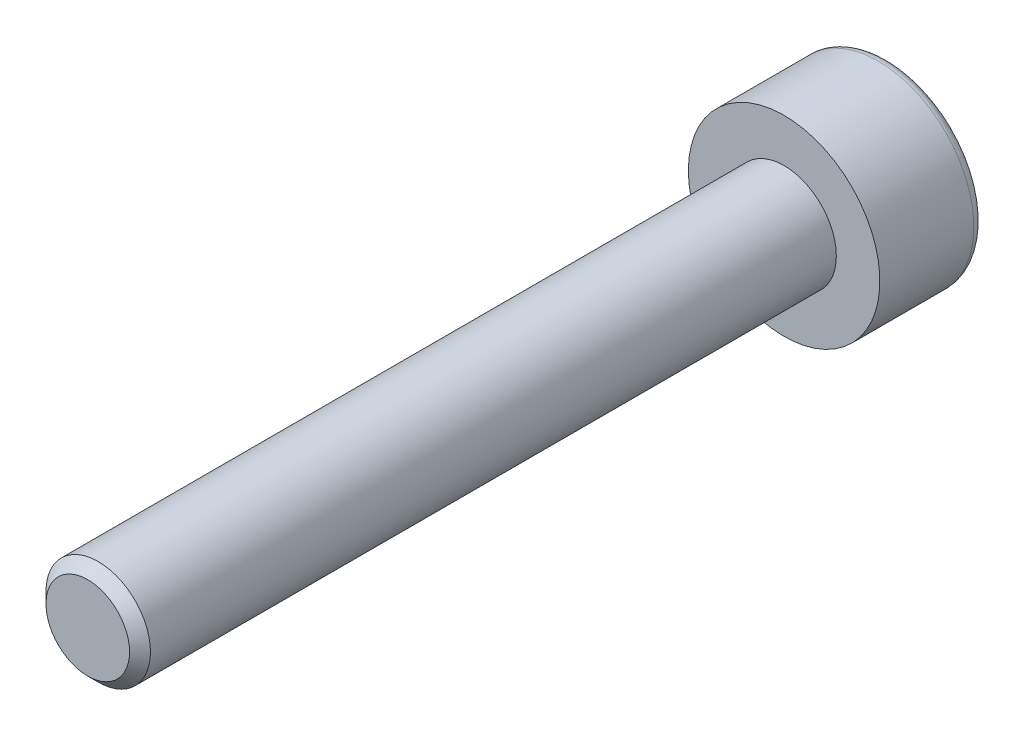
ISO-10303-21;
HEADER;
FILE_DESCRIPTION(('STEP AP214'),'2;1');
FILE_NAME('part.step','',(''),(''),'','','');
FILE_SCHEMA(('AUTOMOTIVE_DESIGN { 1 0 10303 214 1 1 1 1 }'));
ENDSEC;
DATA;
#1=APPLICATION_CONTEXT('core data for automotive mechanical design processes');
#2=APPLICATION_PROTOCOL_DEFINITION('international standard','automotive_design',2000,#1);
#3=PRODUCT_CONTEXT('',#1,'mechanical');
#4=PRODUCT('Part','Part','',(#3));
#5=PRODUCT_RELATED_PRODUCT_CATEGORY('part','',(#4));
#6=PRODUCT_DEFINITION_FORMATION('','',#4);
#7=PRODUCT_DEFINITION_CONTEXT('part definition',#1,'design');
#8=PRODUCT_DEFINITION('design','',#6,#7);
#9=PRODUCT_DEFINITION_SHAPE('','',#8);
#10=(LENGTH_UNIT() NAMED_UNIT(*) SI_UNIT(.MILLI.,.METRE.));
#11=(NAMED_UNIT(*) PLANE_ANGLE_UNIT() SI_UNIT($,.RADIAN.));
#12=(NAMED_UNIT(*) SI_UNIT($,.STERADIAN.) SOLID_ANGLE_UNIT());
#13=UNCERTAINTY_MEASURE_WITH_UNIT(LENGTH_MEASURE(1.E-05),#10,'distance_accuracy_value','');
#14=(GEOMETRIC_REPRESENTATION_CONTEXT(3) GLOBAL_UNCERTAINTY_ASSIGNED_CONTEXT((#13)) GLOBAL_UNIT_ASSIGNED_CONTEXT((#10,
#11,#12)) REPRESENTATION_CONTEXT('',''));
#15=CARTESIAN_POINT('',(0.,0.,0.));
#16=DIRECTION('',(0.,0.,1.));
#17=DIRECTION('',(1.,0.,0.));
#18=AXIS2_PLACEMENT_3D('',#15,#16,#17);
#19=CARTESIAN_POINT('',(0.,0.,-3.));
#20=DIRECTION('',(0.,0.,1.));
#21=DIRECTION('',(1.,0.,0.));
#22=AXIS2_PLACEMENT_3D('',#19,#20,#21);
#23=PLANE('',#22);
#24=CARTESIAN_POINT('',(0.,0.,-3.));
#25=DIRECTION('',(0.,0.,-1.));
#26=DIRECTION('',(-1.,0.,0.));
#27=AXIS2_PLACEMENT_3D('',#24,#25,#26);
#28=CIRCLE('',#27,2.45);
#29=CARTESIAN_POINT('',(-2.45,0.,-3.));
#30=VERTEX_POINT('',#29);
#31=EDGE_CURVE('E478',#30,#30,#28,.T.);
#32=ORIENTED_EDGE('',*,*,#31,.T.);
#33=EDGE_LOOP('',(#32));
#34=FACE_BOUND('',#33,.T.);
#35=DIRECTION('',(-0.86602540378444,0.499999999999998,0.));
#36=VECTOR('',#35,1.);
#37=CARTESIAN_POINT('',(0.,1.44337567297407,-3.));
#38=LINE('',#37,#36);
#39=CARTESIAN_POINT('',(1.25,0.721687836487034,-3.));
#40=VERTEX_POINT('',#39);
#41=CARTESIAN_POINT('',(0.,1.44337567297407,-3.));
#42=VERTEX_POINT('',#41);
#43=EDGE_CURVE('E382',#40,#42,#38,.T.);
#44=ORIENTED_EDGE('',*,*,#43,.T.);
#45=DIRECTION('',(-0.866025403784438,-0.500000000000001,0.));
#46=VECTOR('',#45,1.);
#47=CARTESIAN_POINT('',(0.,1.44337567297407,-3.));
#48=LINE('',#47,#46);
#49=CARTESIAN_POINT('',(-1.25,0.721687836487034,-3.));
#50=VERTEX_POINT('',#49);
#51=EDGE_CURVE('E422',#42,#50,#48,.T.);
#52=ORIENTED_EDGE('',*,*,#51,.T.);
#53=DIRECTION('',(0.,-1.,0.));
#54=VECTOR('',#53,1.);
#55=CARTESIAN_POINT('',(-1.25,-0.721687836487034,-3.));
#56=LINE('',#55,#54);
#57=CARTESIAN_POINT('',(-1.25,-0.721687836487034,-3.));
#58=VERTEX_POINT('',#57);
#59=EDGE_CURVE('E430',#50,#58,#56,.T.);
#60=ORIENTED_EDGE('',*,*,#59,.T.);
#61=DIRECTION('',(0.866025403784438,-0.500000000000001,0.));
#62=VECTOR('',#61,1.);
#63=CARTESIAN_POINT('',(0.,-1.44337567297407,-3.));
#64=LINE('',#63,#62);
#65=CARTESIAN_POINT('',(0.,-1.44337567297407,-3.));
#66=VERTEX_POINT('',#65);
#67=EDGE_CURVE('E448',#58,#66,#64,.T.);
#68=ORIENTED_EDGE('',*,*,#67,.T.);
#69=DIRECTION('',(0.86602540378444,0.499999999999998,0.));
#70=VECTOR('',#69,1.);
#71=CARTESIAN_POINT('',(0.,-1.44337567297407,-3.));
#72=LINE('',#71,#70);
#73=CARTESIAN_POINT('',(1.25,-0.721687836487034,-3.));
#74=VERTEX_POINT('',#73);
#75=EDGE_CURVE('E451',#66,#74,#72,.T.);
#76=ORIENTED_EDGE('',*,*,#75,.T.);
#77=DIRECTION('',(0.,1.,0.));
#78=VECTOR('',#77,1.);
#79=CARTESIAN_POINT('',(1.25,-0.721687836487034,-3.));
#80=LINE('',#79,#78);
#81=EDGE_CURVE('E441',#74,#40,#80,.T.);
#82=ORIENTED_EDGE('',*,*,#81,.T.);
#83=EDGE_LOOP('',(#44,#52,#60,#68,#76,#82));
#84=FACE_BOUND('',#83,.T.);
#85=ADVANCED_FACE('F368',(#34,#84),#23,.F.);
#86=CARTESIAN_POINT('',(0.,0.,-2.7));
#87=DIRECTION('',(0.,0.,-1.));
#88=DIRECTION('',(-1.,0.,0.));
#89=AXIS2_PLACEMENT_3D('',#86,#87,#88);
#90=TOROIDAL_SURFACE('',#89,2.45,0.299999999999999);
#91=ORIENTED_EDGE('',*,*,#31,.F.);
#92=EDGE_LOOP('',(#91));
#93=FACE_BOUND('',#92,.T.);
#94=CARTESIAN_POINT('',(0.,0.,-2.7));
#95=DIRECTION('',(0.,0.,-1.));
#96=DIRECTION('',(-1.,0.,0.));
#97=AXIS2_PLACEMENT_3D('',#94,#95,#96);
#98=CIRCLE('',#97,2.75);
#99=CARTESIAN_POINT('',(-2.75,0.,-2.7));
#100=VERTEX_POINT('',#99);
#101=EDGE_CURVE('E475',#100,#100,#98,.T.);
#102=ORIENTED_EDGE('',*,*,#101,.T.);
#103=EDGE_LOOP('',(#102));
#104=FACE_BOUND('',#103,.T.);
#105=ADVANCED_FACE('F497',(#93,#104),#90,.T.);
#106=CARTESIAN_POINT('',(0.,0.,0.));
#107=DIRECTION('',(0.,0.,-1.));
#108=DIRECTION('',(-1.,0.,0.));
#109=AXIS2_PLACEMENT_3D('',#106,#107,#108);
#110=CYLINDRICAL_SURFACE('',#109,2.75);
#111=ORIENTED_EDGE('',*,*,#101,.F.);
#112=EDGE_LOOP('',(#111));
#113=FACE_BOUND('',#112,.T.);
#114=CARTESIAN_POINT('',(0.,0.,0.));
#115=DIRECTION('',(0.,0.,-1.));
#116=DIRECTION('',(-1.,0.,0.));
#117=AXIS2_PLACEMENT_3D('',#114,#115,#116);
#118=CIRCLE('',#117,2.75);
#119=CARTESIAN_POINT('',(-2.75,0.,0.));
#120=VERTEX_POINT('',#119);
#121=EDGE_CURVE('E436',#120,#120,#118,.T.);
#122=ORIENTED_EDGE('',*,*,#121,.T.);
#123=EDGE_LOOP('',(#122));
#124=FACE_BOUND('',#123,.T.);
#125=ADVANCED_FACE('F504',(#113,#124),#110,.T.);
#126=CARTESIAN_POINT('',(0.,0.,0.));
#127=DIRECTION('',(0.,0.,-1.));
#128=DIRECTION('',(-1.,0.,0.));
#129=AXIS2_PLACEMENT_3D('',#126,#127,#128);
#130=PLANE('',#129);
#131=CARTESIAN_POINT('',(0.,0.,0.));
#132=DIRECTION('',(0.,0.,1.));
#133=DIRECTION('',(1.,0.,0.));
#134=AXIS2_PLACEMENT_3D('',#131,#132,#133);
#135=CIRCLE('',#134,1.5);
#136=CARTESIAN_POINT('',(1.5,0.,0.));
#137=VERTEX_POINT('',#136);
#138=EDGE_CURVE('E442',#137,#137,#135,.T.);
#139=ORIENTED_EDGE('',*,*,#138,.F.);
#140=EDGE_LOOP('',(#139));
#141=FACE_BOUND('',#140,.T.);
#142=ORIENTED_EDGE('',*,*,#121,.F.);
#143=EDGE_LOOP('',(#142));
#144=FACE_BOUND('',#143,.T.);
#145=ADVANCED_FACE('F511',(#141,#144),#130,.F.);
#146=CARTESIAN_POINT('',(0.,1.44337567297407,-1.7));
#147=DIRECTION('',(-0.499999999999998,-0.86602540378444,0.));
#148=DIRECTION('',(0.86602540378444,-0.499999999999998,0.));
#149=AXIS2_PLACEMENT_3D('',#146,#147,#148);
#150=PLANE('',#149);
#151=ORIENTED_EDGE('',*,*,#43,.F.);
#152=DIRECTION('',(0.,0.,-1.));
#153=VECTOR('',#152,1.);
#154=CARTESIAN_POINT('',(1.25,0.721687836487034,-1.7));
#155=LINE('',#154,#153);
#156=CARTESIAN_POINT('',(1.25,0.721687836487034,-1.7));
#157=VERTEX_POINT('',#156);
#158=EDGE_CURVE('E464',#157,#40,#155,.T.);
#159=ORIENTED_EDGE('',*,*,#158,.F.);
#160=DIRECTION('',(-0.86602540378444,0.499999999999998,0.));
#161=VECTOR('',#160,1.);
#162=CARTESIAN_POINT('',(0.,1.44337567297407,-1.7));
#163=LINE('',#162,#161);
#164=CARTESIAN_POINT('',(0.,1.44337567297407,-1.7));
#165=VERTEX_POINT('',#164);
#166=EDGE_CURVE('E435',#157,#165,#163,.T.);
#167=ORIENTED_EDGE('',*,*,#166,.T.);
#168=DIRECTION('',(0.,0.,-1.));
#169=VECTOR('',#168,1.);
#170=CARTESIAN_POINT('',(0.,1.44337567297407,-1.7));
#171=LINE('',#170,#169);
#172=EDGE_CURVE('E424',#165,#42,#171,.T.);
#173=ORIENTED_EDGE('',*,*,#172,.T.);
#174=EDGE_LOOP('',(#151,#159,#167,#173));
#175=FACE_BOUND('',#174,.T.);
#176=ADVANCED_FACE('F433',(#175),#150,.T.);
#177=CARTESIAN_POINT('',(0.,1.44337567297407,-1.7));
#178=DIRECTION('',(0.500000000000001,-0.866025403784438,0.));
#179=DIRECTION('',(0.866025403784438,0.500000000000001,0.));
#180=AXIS2_PLACEMENT_3D('',#177,#178,#179);
#181=PLANE('',#180);
#182=ORIENTED_EDGE('',*,*,#51,.F.);
#183=ORIENTED_EDGE('',*,*,#172,.F.);
#184=DIRECTION('',(-0.866025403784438,-0.500000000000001,0.));
#185=VECTOR('',#184,1.);
#186=CARTESIAN_POINT('',(0.,1.44337567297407,-1.7));
#187=LINE('',#186,#185);
#188=CARTESIAN_POINT('',(-1.25,0.721687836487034,-1.7));
#189=VERTEX_POINT('',#188);
#190=EDGE_CURVE('E455',#165,#189,#187,.T.);
#191=ORIENTED_EDGE('',*,*,#190,.T.);
#192=DIRECTION('',(0.,0.,-1.));
#193=VECTOR('',#192,1.);
#194=CARTESIAN_POINT('',(-1.25,0.721687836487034,-1.7));
#195=LINE('',#194,#193);
#196=EDGE_CURVE('E426',#189,#50,#195,.T.);
#197=ORIENTED_EDGE('',*,*,#196,.T.);
#198=EDGE_LOOP('',(#182,#183,#191,#197));
#199=FACE_BOUND('',#198,.T.);
#200=ADVANCED_FACE('F423',(#199),#181,.T.);
#201=CARTESIAN_POINT('',(-1.25,-0.721687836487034,-1.7));
#202=DIRECTION('',(1.,0.,0.));
#203=DIRECTION('',(0.,0.,-1.));
#204=AXIS2_PLACEMENT_3D('',#201,#202,#203);
#205=PLANE('',#204);
#206=ORIENTED_EDGE('',*,*,#59,.F.);
#207=ORIENTED_EDGE('',*,*,#196,.F.);
#208=DIRECTION('',(0.,-1.,0.));
#209=VECTOR('',#208,1.);
#210=CARTESIAN_POINT('',(-1.25,-0.721687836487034,-1.7));
#211=LINE('',#210,#209);
#212=CARTESIAN_POINT('',(-1.25,-0.721687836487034,-1.7));
#213=VERTEX_POINT('',#212);
#214=EDGE_CURVE('E457',#189,#213,#211,.T.);
#215=ORIENTED_EDGE('',*,*,#214,.T.);
#216=DIRECTION('',(0.,0.,-1.));
#217=VECTOR('',#216,1.);
#218=CARTESIAN_POINT('',(-1.25,-0.721687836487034,-1.7));
#219=LINE('',#218,#217);
#220=EDGE_CURVE('E470',#213,#58,#219,.T.);
#221=ORIENTED_EDGE('',*,*,#220,.T.);
#222=EDGE_LOOP('',(#206,#207,#215,#221));
#223=FACE_BOUND('',#222,.T.);
#224=ADVANCED_FACE('F527',(#223),#205,.T.);
#225=CARTESIAN_POINT('',(0.,-1.44337567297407,-1.7));
#226=DIRECTION('',(0.500000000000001,0.866025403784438,0.));
#227=DIRECTION('',(-0.866025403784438,0.500000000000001,0.));
#228=AXIS2_PLACEMENT_3D('',#225,#226,#227);
#229=PLANE('',#228);
#230=ORIENTED_EDGE('',*,*,#67,.F.);
#231=ORIENTED_EDGE('',*,*,#220,.F.);
#232=DIRECTION('',(0.866025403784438,-0.500000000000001,0.));
#233=VECTOR('',#232,1.);
#234=CARTESIAN_POINT('',(0.,-1.44337567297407,-1.7));
#235=LINE('',#234,#233);
#236=CARTESIAN_POINT('',(0.,-1.44337567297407,-1.7));
#237=VERTEX_POINT('',#236);
#238=EDGE_CURVE('E459',#213,#237,#235,.T.);
#239=ORIENTED_EDGE('',*,*,#238,.T.);
#240=DIRECTION('',(0.,0.,-1.));
#241=VECTOR('',#240,1.);
#242=CARTESIAN_POINT('',(0.,-1.44337567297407,-1.7));
#243=LINE('',#242,#241);
#244=EDGE_CURVE('E468',#237,#66,#243,.T.);
#245=ORIENTED_EDGE('',*,*,#244,.T.);
#246=EDGE_LOOP('',(#230,#231,#239,#245));
#247=FACE_BOUND('',#246,.T.);
#248=ADVANCED_FACE('F530',(#247),#229,.T.);
#249=CARTESIAN_POINT('',(0.,-1.44337567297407,-1.7));
#250=DIRECTION('',(-0.499999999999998,0.86602540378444,0.));
#251=DIRECTION('',(-0.86602540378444,-0.499999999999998,0.));
#252=AXIS2_PLACEMENT_3D('',#249,#250,#251);
#253=PLANE('',#252);
#254=ORIENTED_EDGE('',*,*,#75,.F.);
#255=ORIENTED_EDGE('',*,*,#244,.F.);
#256=DIRECTION('',(0.86602540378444,0.499999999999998,0.));
#257=VECTOR('',#256,1.);
#258=CARTESIAN_POINT('',(0.,-1.44337567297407,-1.7));
#259=LINE('',#258,#257);
#260=CARTESIAN_POINT('',(1.25,-0.721687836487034,-1.7));
#261=VERTEX_POINT('',#260);
#262=EDGE_CURVE('E461',#237,#261,#259,.T.);
#263=ORIENTED_EDGE('',*,*,#262,.T.);
#264=DIRECTION('',(0.,0.,-1.));
#265=VECTOR('',#264,1.);
#266=CARTESIAN_POINT('',(1.25,-0.721687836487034,-1.7));
#267=LINE('',#266,#265);
#268=EDGE_CURVE('E466',#261,#74,#267,.T.);
#269=ORIENTED_EDGE('',*,*,#268,.T.);
#270=EDGE_LOOP('',(#254,#255,#263,#269));
#271=FACE_BOUND('',#270,.T.);
#272=ADVANCED_FACE('F534',(#271),#253,.T.);
#273=CARTESIAN_POINT('',(1.25,-0.721687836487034,-1.7));
#274=DIRECTION('',(-1.,0.,0.));
#275=DIRECTION('',(0.,0.,1.));
#276=AXIS2_PLACEMENT_3D('',#273,#274,#275);
#277=PLANE('',#276);
#278=ORIENTED_EDGE('',*,*,#81,.F.);
#279=ORIENTED_EDGE('',*,*,#268,.F.);
#280=DIRECTION('',(0.,1.,0.));
#281=VECTOR('',#280,1.);
#282=CARTESIAN_POINT('',(1.25,-0.721687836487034,-1.7));
#283=LINE('',#282,#281);
#284=EDGE_CURVE('E389',#261,#157,#283,.T.);
#285=ORIENTED_EDGE('',*,*,#284,.T.);
#286=ORIENTED_EDGE('',*,*,#158,.T.);
#287=EDGE_LOOP('',(#278,#279,#285,#286));
#288=FACE_BOUND('',#287,.T.);
#289=ADVANCED_FACE('F538',(#288),#277,.T.);
#290=CARTESIAN_POINT('',(1.25,0.721687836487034,-1.7));
#291=DIRECTION('',(0.,0.,1.));
#292=DIRECTION('',(1.,0.,0.));
#293=AXIS2_PLACEMENT_3D('',#290,#291,#292);
#294=PLANE('',#293);
#295=ORIENTED_EDGE('',*,*,#166,.F.);
#296=ORIENTED_EDGE('',*,*,#284,.F.);
#297=ORIENTED_EDGE('',*,*,#262,.F.);
#298=ORIENTED_EDGE('',*,*,#238,.F.);
#299=ORIENTED_EDGE('',*,*,#214,.F.);
#300=ORIENTED_EDGE('',*,*,#190,.F.);
#301=EDGE_LOOP('',(#295,#296,#297,#298,#299,#300));
#302=FACE_BOUND('',#301,.T.);
#303=ADVANCED_FACE('F542',(#302),#294,.F.);
#304=CARTESIAN_POINT('',(0.,0.,20.));
#305=DIRECTION('',(0.,0.,1.));
#306=DIRECTION('',(1.,0.,0.));
#307=AXIS2_PLACEMENT_3D('',#304,#305,#306);
#308=PLANE('',#307);
#309=CARTESIAN_POINT('',(0.,0.,20.));
#310=DIRECTION('',(0.,0.,1.));
#311=DIRECTION('',(1.,0.,0.));
#312=AXIS2_PLACEMENT_3D('',#309,#310,#311);
#313=CIRCLE('',#312,1.2);
#314=CARTESIAN_POINT('',(1.2,0.,20.));
#315=VERTEX_POINT('',#314);
#316=EDGE_CURVE('E375',#315,#315,#313,.T.);
#317=ORIENTED_EDGE('',*,*,#316,.T.);
#318=EDGE_LOOP('',(#317));
#319=FACE_BOUND('',#318,.T.);
#320=ADVANCED_FACE('F483',(#319),#308,.T.);
#321=CARTESIAN_POINT('',(0.,0.,0.));
#322=DIRECTION('',(0.,0.,1.));
#323=DIRECTION('',(1.,0.,0.));
#324=AXIS2_PLACEMENT_3D('',#321,#322,#323);
#325=CYLINDRICAL_SURFACE('',#324,1.5);
#326=CARTESIAN_POINT('',(0.,0.,19.7));
#327=DIRECTION('',(0.,0.,1.));
#328=DIRECTION('',(1.,0.,0.));
#329=AXIS2_PLACEMENT_3D('',#326,#327,#328);
#330=CIRCLE('',#329,1.5);
#331=CARTESIAN_POINT('',(1.5,0.,19.7));
#332=VERTEX_POINT('',#331);
#333=EDGE_CURVE('E11',#332,#332,#330,.F.);
#334=ORIENTED_EDGE('',*,*,#333,.T.);
#335=EDGE_LOOP('',(#334));
#336=FACE_BOUND('',#335,.T.);
#337=ORIENTED_EDGE('',*,*,#138,.T.);
#338=EDGE_LOOP('',(#337));
#339=FACE_BOUND('',#338,.T.);
#340=ADVANCED_FACE('F487',(#336,#339),#325,.T.);
#341=CARTESIAN_POINT('',(0.,0.,20.));
#342=DIRECTION('',(0.,0.,-1.));
#343=DIRECTION('',(-1.,0.,0.));
#344=AXIS2_PLACEMENT_3D('',#341,#342,#343);
#345=CONICAL_SURFACE('',#344,1.2,0.785398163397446);
#346=ORIENTED_EDGE('',*,*,#333,.F.);
#347=EDGE_LOOP('',(#346));
#348=FACE_BOUND('',#347,.T.);
#349=ORIENTED_EDGE('',*,*,#316,.F.);
#350=EDGE_LOOP('',(#349));
#351=FACE_BOUND('',#350,.T.);
#352=ADVANCED_FACE('F485',(#348,#351),#345,.T.);
#353=CLOSED_SHELL('',(#85,#105,#125,#145,#176,#200,#224,#248,#272,#289,#303,#320,#340,#352));
#354=MANIFOLD_SOLID_BREP('B2',#353);
#355=ADVANCED_BREP_SHAPE_REPRESENTATION('',(#18,#354),#14);
#356=SHAPE_DEFINITION_REPRESENTATION(#9,#355);
ENDSEC;
END-ISO-10303-21;
